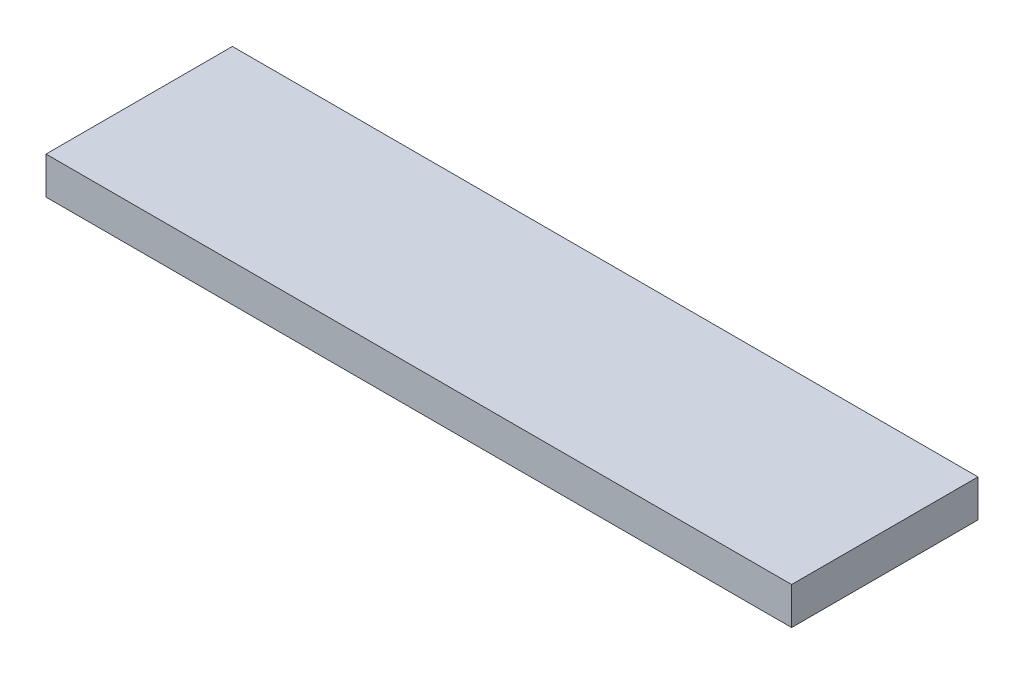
from build123d import *

# Parameters (mm, degrees)
SKETCH1_W           = 25
SKETCH1_H           = 5
BOSS_EXTRUDE1_DEPTH = 100


with BuildPart() as part:
    # Sketch1 → Boss-Extrude1 (new body)
    with BuildSketch(Plane(origin=(0, 0, 0), x_dir=(0, 0, -1), z_dir=(1, 0, 0))):
        with Locations((12.5, 2.5)):
            Rectangle(SKETCH1_W, SKETCH1_H)
    extrude(amount=BOSS_EXTRUDE1_DEPTH)


solid = part.part
